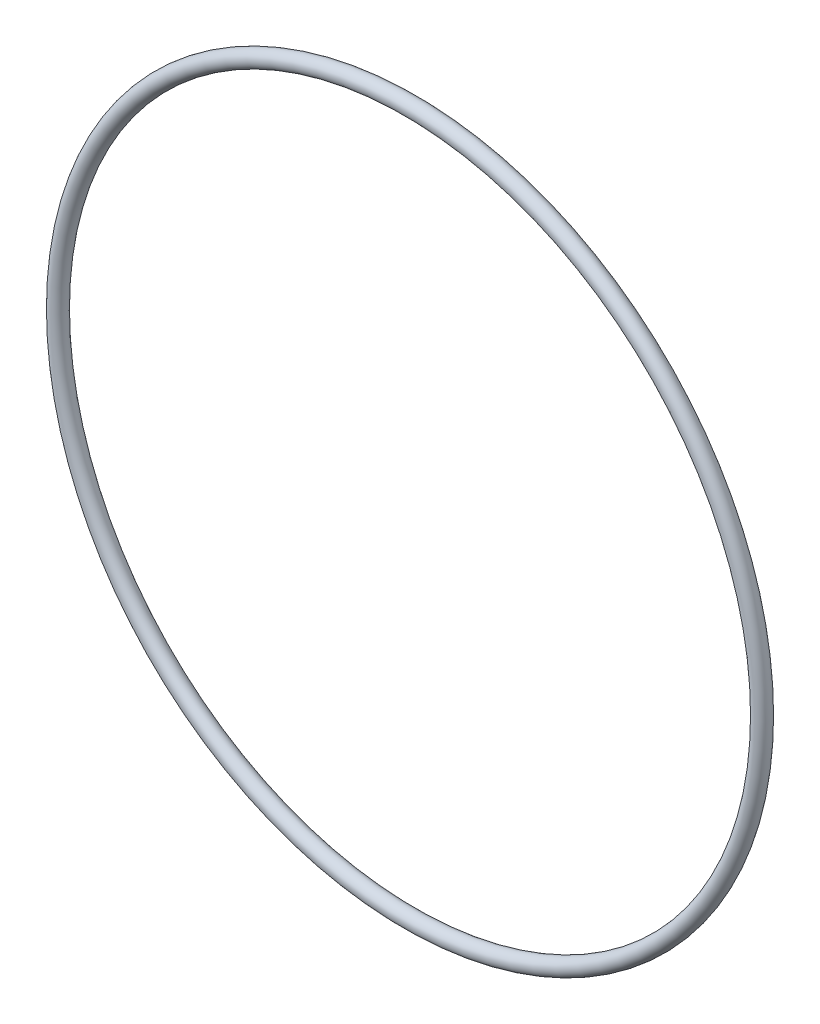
from build123d import *

# Parameters (mm, degrees)
SKETCH1_R = 0.889


with BuildPart() as part:
    # Sweep1: sweep along a path in Sketch3
    with BuildLine(Plane.XY) as sweep1_path:
        CenterArc((38.39045, 0), 38.39045, 0, 360)
    # Sketch1 → Sweep1 (sweep)
    with BuildSketch(Plane(origin=(0, 0, 0), x_dir=(1, 0, 0), z_dir=(0, 1, 0))):
        Circle(SKETCH1_R)
    sweep(path=sweep1_path.line)


solid = part.part
